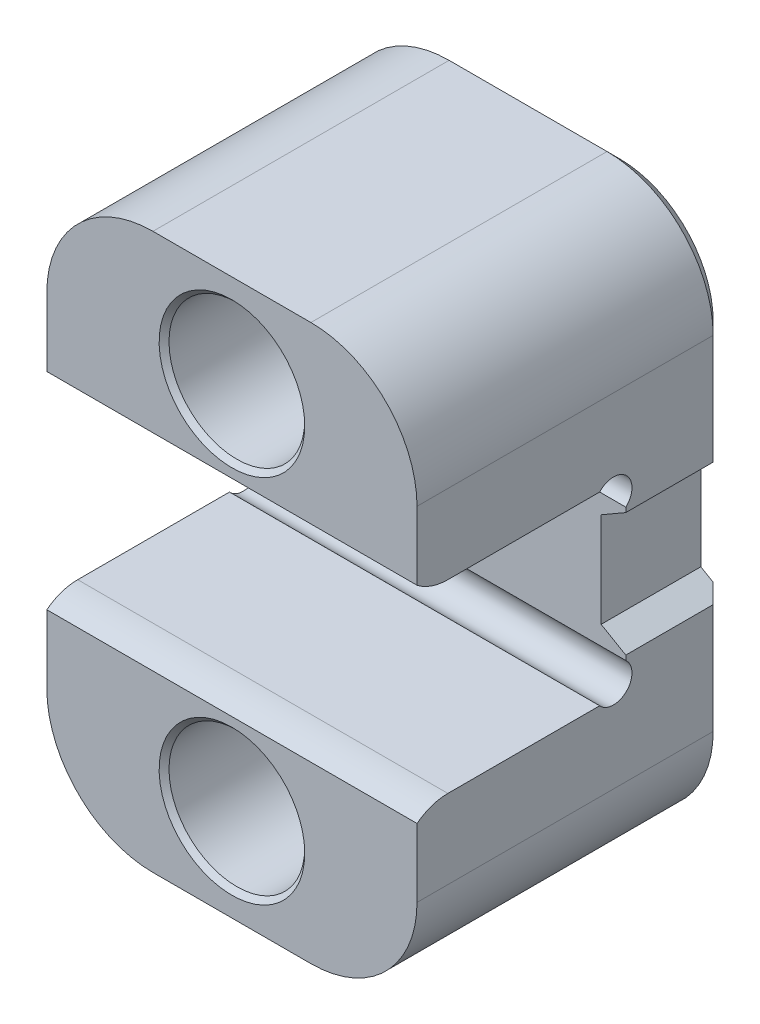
ISO-10303-21;
HEADER;
FILE_DESCRIPTION(('STEP AP214'),'2;1');
FILE_NAME('part.step','',(''),(''),'','','');
FILE_SCHEMA(('AUTOMOTIVE_DESIGN { 1 0 10303 214 1 1 1 1 }'));
ENDSEC;
DATA;
#1=APPLICATION_CONTEXT('core data for automotive mechanical design processes');
#2=APPLICATION_PROTOCOL_DEFINITION('international standard','automotive_design',2000,#1);
#3=PRODUCT_CONTEXT('',#1,'mechanical');
#4=PRODUCT('Part','Part','',(#3));
#5=PRODUCT_RELATED_PRODUCT_CATEGORY('part','',(#4));
#6=PRODUCT_DEFINITION_FORMATION('','',#4);
#7=PRODUCT_DEFINITION_CONTEXT('part definition',#1,'design');
#8=PRODUCT_DEFINITION('design','',#6,#7);
#9=PRODUCT_DEFINITION_SHAPE('','',#8);
#10=(LENGTH_UNIT() NAMED_UNIT(*) SI_UNIT(.MILLI.,.METRE.));
#11=(NAMED_UNIT(*) PLANE_ANGLE_UNIT() SI_UNIT($,.RADIAN.));
#12=(NAMED_UNIT(*) SI_UNIT($,.STERADIAN.) SOLID_ANGLE_UNIT());
#13=UNCERTAINTY_MEASURE_WITH_UNIT(LENGTH_MEASURE(1.E-05),#10,'distance_accuracy_value','');
#14=(GEOMETRIC_REPRESENTATION_CONTEXT(3) GLOBAL_UNCERTAINTY_ASSIGNED_CONTEXT((#13)) GLOBAL_UNIT_ASSIGNED_CONTEXT((#10,
#11,#12)) REPRESENTATION_CONTEXT('',''));
#15=CARTESIAN_POINT('',(0.,0.,0.));
#16=DIRECTION('',(0.,0.,1.));
#17=DIRECTION('',(1.,0.,0.));
#18=AXIS2_PLACEMENT_3D('',#15,#16,#17);
#19=CARTESIAN_POINT('',(15.,-7.5,0.));
#20=DIRECTION('',(-1.,0.,0.));
#21=DIRECTION('',(0.,0.,1.));
#22=AXIS2_PLACEMENT_3D('',#19,#20,#21);
#23=PLANE('',#22);
#24=DIRECTION('',(0.,0.,1.));
#25=VECTOR('',#24,1.);
#26=CARTESIAN_POINT('',(15.,5.,-25.));
#27=LINE('',#26,#25);
#28=CARTESIAN_POINT('',(15.,5.,-24.));
#29=VERTEX_POINT('',#28);
#30=CARTESIAN_POINT('',(15.,5.,-16.92));
#31=VERTEX_POINT('',#30);
#32=EDGE_CURVE('E419',#29,#31,#27,.T.);
#33=ORIENTED_EDGE('',*,*,#32,.F.);
#34=DIRECTION('',(0.,1.,0.));
#35=VECTOR('',#34,1.);
#36=CARTESIAN_POINT('',(15.,-7.5,-24.));
#37=LINE('',#36,#35);
#38=CARTESIAN_POINT('',(15.,13.9,-24.));
#39=VERTEX_POINT('',#38);
#40=EDGE_CURVE('E295',#29,#39,#37,.T.);
#41=ORIENTED_EDGE('',*,*,#40,.T.);
#42=DIRECTION('',(0.,0.,1.));
#43=VECTOR('',#42,1.);
#44=CARTESIAN_POINT('',(15.,13.9,0.));
#45=LINE('',#44,#43);
#46=CARTESIAN_POINT('',(15.,13.9,0.));
#47=VERTEX_POINT('',#46);
#48=EDGE_CURVE('E243',#39,#47,#45,.T.);
#49=ORIENTED_EDGE('',*,*,#48,.T.);
#50=DIRECTION('',(0.,-1.,0.));
#51=VECTOR('',#50,1.);
#52=CARTESIAN_POINT('',(15.,22.5,0.));
#53=LINE('',#52,#51);
#54=CARTESIAN_POINT('',(15.,8.35903533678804,0.));
#55=VERTEX_POINT('',#54);
#56=EDGE_CURVE('E230',#47,#55,#53,.T.);
#57=ORIENTED_EDGE('',*,*,#56,.T.);
#58=CARTESIAN_POINT('',(15.,11.5673187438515,-2.49999986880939));
#59=DIRECTION('',(-1.,0.,0.));
#60=DIRECTION('',(0.,0.,-1.));
#61=AXIS2_PLACEMENT_3D('',#58,#59,#60);
#62=CIRCLE('',#61,4.06731874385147);
#63=CARTESIAN_POINT('',(15.,7.5,-2.49999999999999));
#64=VERTEX_POINT('',#63);
#65=EDGE_CURVE('E466',#64,#55,#62,.T.);
#66=ORIENTED_EDGE('',*,*,#65,.F.);
#67=DIRECTION('',(0.,0.,-1.));
#68=VECTOR('',#67,1.);
#69=CARTESIAN_POINT('',(15.,7.5,0.));
#70=LINE('',#69,#68);
#71=CARTESIAN_POINT('',(15.,7.5,-14.8019660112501));
#72=VERTEX_POINT('',#71);
#73=EDGE_CURVE('E434',#64,#72,#70,.T.);
#74=ORIENTED_EDGE('',*,*,#73,.T.);
#75=CARTESIAN_POINT('',(15.,6.5,-15.92));
#76=DIRECTION('',(1.,0.,0.));
#77=DIRECTION('',(0.,0.,-1.));
#78=AXIS2_PLACEMENT_3D('',#75,#76,#77);
#79=CIRCLE('',#78,1.5);
#80=CARTESIAN_POINT('',(15.,5.38196601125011,-16.92));
#81=VERTEX_POINT('',#80);
#82=EDGE_CURVE('E464',#81,#72,#79,.T.);
#83=ORIENTED_EDGE('',*,*,#82,.F.);
#84=DIRECTION('',(0.,-1.,0.));
#85=VECTOR('',#84,1.);
#86=CARTESIAN_POINT('',(15.,7.5,-16.92));
#87=LINE('',#86,#85);
#88=EDGE_CURVE('E438',#81,#31,#87,.T.);
#89=ORIENTED_EDGE('',*,*,#88,.T.);
#90=EDGE_LOOP('',(#33,#41,#49,#57,#66,#74,#83,#89));
#91=FACE_BOUND('',#90,.T.);
#92=ADVANCED_FACE('F33',(#91),#23,.F.);
#93=CARTESIAN_POINT('',(15.,22.5,0.));
#94=DIRECTION('',(0.,0.,-1.));
#95=DIRECTION('',(0.,1.,0.));
#96=AXIS2_PLACEMENT_3D('',#93,#94,#95);
#97=PLANE('',#96);
#98=CARTESIAN_POINT('',(0.,15.,0.));
#99=DIRECTION('',(0.,0.,-1.));
#100=DIRECTION('',(0.,1.,0.));
#101=AXIS2_PLACEMENT_3D('',#98,#99,#100);
#102=CIRCLE('',#101,5.9);
#103=CARTESIAN_POINT('',(0.,20.9,0.));
#104=VERTEX_POINT('',#103);
#105=EDGE_CURVE('E11',#104,#104,#102,.T.);
#106=ORIENTED_EDGE('',*,*,#105,.T.);
#107=EDGE_LOOP('',(#106));
#108=FACE_BOUND('',#107,.T.);
#109=DIRECTION('',(0.,-1.,0.));
#110=VECTOR('',#109,1.);
#111=CARTESIAN_POINT('',(-15.,22.5,0.));
#112=LINE('',#111,#110);
#113=CARTESIAN_POINT('',(-15.,13.9,0.));
#114=VERTEX_POINT('',#113);
#115=CARTESIAN_POINT('',(-15.,8.35903533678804,0.));
#116=VERTEX_POINT('',#115);
#117=EDGE_CURVE('E431',#114,#116,#112,.T.);
#118=ORIENTED_EDGE('',*,*,#117,.T.);
#119=DIRECTION('',(1.,0.,0.));
#120=VECTOR('',#119,1.);
#121=CARTESIAN_POINT('',(-15.,8.35903533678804,0.));
#122=LINE('',#121,#120);
#123=EDGE_CURVE('E472',#116,#55,#122,.T.);
#124=ORIENTED_EDGE('',*,*,#123,.T.);
#125=ORIENTED_EDGE('',*,*,#56,.F.);
#126=CARTESIAN_POINT('',(6.4,13.9,0.));
#127=DIRECTION('',(0.,0.,-1.));
#128=DIRECTION('',(0.,1.,0.));
#129=AXIS2_PLACEMENT_3D('',#126,#127,#128);
#130=CIRCLE('',#129,8.6);
#131=CARTESIAN_POINT('',(6.4,22.5,0.));
#132=VERTEX_POINT('',#131);
#133=EDGE_CURVE('E260',#47,#132,#130,.F.);
#134=ORIENTED_EDGE('',*,*,#133,.T.);
#135=DIRECTION('',(-1.,0.,0.));
#136=VECTOR('',#135,1.);
#137=CARTESIAN_POINT('',(15.,22.5,0.));
#138=LINE('',#137,#136);
#139=CARTESIAN_POINT('',(-6.4,22.5,0.));
#140=VERTEX_POINT('',#139);
#141=EDGE_CURVE('E236',#132,#140,#138,.T.);
#142=ORIENTED_EDGE('',*,*,#141,.T.);
#143=CARTESIAN_POINT('',(-6.4,13.9,0.));
#144=DIRECTION('',(0.,0.,-1.));
#145=DIRECTION('',(0.,1.,0.));
#146=AXIS2_PLACEMENT_3D('',#143,#144,#145);
#147=CIRCLE('',#146,8.6);
#148=EDGE_CURVE('E258',#140,#114,#147,.F.);
#149=ORIENTED_EDGE('',*,*,#148,.T.);
#150=EDGE_LOOP('',(#118,#124,#125,#134,#142,#149));
#151=FACE_BOUND('',#150,.T.);
#152=ADVANCED_FACE('F357',(#108,#151),#97,.F.);
#153=CARTESIAN_POINT('',(15.,7.5,0.));
#154=DIRECTION('',(0.,1.,0.));
#155=DIRECTION('',(0.,0.,1.));
#156=AXIS2_PLACEMENT_3D('',#153,#154,#155);
#157=PLANE('',#156);
#158=DIRECTION('',(0.,0.,-1.));
#159=VECTOR('',#158,1.);
#160=CARTESIAN_POINT('',(-15.,7.5,0.));
#161=LINE('',#160,#159);
#162=CARTESIAN_POINT('',(-15.,7.5,-2.49999999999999));
#163=VERTEX_POINT('',#162);
#164=CARTESIAN_POINT('',(-15.,7.5,-14.8019660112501));
#165=VERTEX_POINT('',#164);
#166=EDGE_CURVE('E232',#163,#165,#161,.T.);
#167=ORIENTED_EDGE('',*,*,#166,.T.);
#168=DIRECTION('',(1.,0.,0.));
#169=VECTOR('',#168,1.);
#170=CARTESIAN_POINT('',(-15.,7.5,-14.8019660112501));
#171=LINE('',#170,#169);
#172=EDGE_CURVE('E450',#165,#72,#171,.T.);
#173=ORIENTED_EDGE('',*,*,#172,.T.);
#174=ORIENTED_EDGE('',*,*,#73,.F.);
#175=DIRECTION('',(1.,0.,0.));
#176=VECTOR('',#175,1.);
#177=CARTESIAN_POINT('',(-15.,7.5,-2.49999999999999));
#178=LINE('',#177,#176);
#179=EDGE_CURVE('E451',#163,#64,#178,.T.);
#180=ORIENTED_EDGE('',*,*,#179,.F.);
#181=EDGE_LOOP('',(#167,#173,#174,#180));
#182=FACE_BOUND('',#181,.T.);
#183=ADVANCED_FACE('F364',(#182),#157,.F.);
#184=CARTESIAN_POINT('',(15.,7.5,-16.92));
#185=DIRECTION('',(0.,0.,-1.));
#186=DIRECTION('',(-1.,0.,0.));
#187=AXIS2_PLACEMENT_3D('',#184,#185,#186);
#188=PLANE('',#187);
#189=DIRECTION('',(0.,-1.,0.));
#190=VECTOR('',#189,1.);
#191=CARTESIAN_POINT('',(-15.,7.5,-16.92));
#192=LINE('',#191,#190);
#193=CARTESIAN_POINT('',(-15.,5.38196601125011,-16.92));
#194=VERTEX_POINT('',#193);
#195=CARTESIAN_POINT('',(-15.,-5.38196601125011,-16.92));
#196=VERTEX_POINT('',#195);
#197=EDGE_CURVE('E227',#194,#196,#192,.T.);
#198=ORIENTED_EDGE('',*,*,#197,.T.);
#199=DIRECTION('',(1.,0.,0.));
#200=VECTOR('',#199,1.);
#201=CARTESIAN_POINT('',(-15.,-5.38196601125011,-16.92));
#202=LINE('',#201,#200);
#203=CARTESIAN_POINT('',(15.,-5.38196601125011,-16.92));
#204=VERTEX_POINT('',#203);
#205=EDGE_CURVE('E207',#196,#204,#202,.T.);
#206=ORIENTED_EDGE('',*,*,#205,.T.);
#207=CARTESIAN_POINT('',(15.,-5.,-16.92));
#208=VERTEX_POINT('',#207);
#209=EDGE_CURVE('E437',#208,#204,#87,.T.);
#210=ORIENTED_EDGE('',*,*,#209,.F.);
#211=DIRECTION('',(-0.866025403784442,0.499999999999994,0.));
#212=VECTOR('',#211,1.);
#213=CARTESIAN_POINT('',(9.5873412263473,-1.87500000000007,-16.92));
#214=LINE('',#213,#212);
#215=CARTESIAN_POINT('',(13.,-3.84529946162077,-16.92));
#216=VERTEX_POINT('',#215);
#217=EDGE_CURVE('E418',#208,#216,#214,.T.);
#218=ORIENTED_EDGE('',*,*,#217,.T.);
#219=DIRECTION('',(0.,1.,0.));
#220=VECTOR('',#219,1.);
#221=CARTESIAN_POINT('',(13.,7.5,-16.92));
#222=LINE('',#221,#220);
#223=CARTESIAN_POINT('',(13.,3.84529946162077,-16.92));
#224=VERTEX_POINT('',#223);
#225=EDGE_CURVE('E428',#216,#224,#222,.T.);
#226=ORIENTED_EDGE('',*,*,#225,.T.);
#227=DIRECTION('',(0.866025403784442,0.499999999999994,0.));
#228=VECTOR('',#227,1.);
#229=CARTESIAN_POINT('',(16.0825317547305,5.62499999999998,-16.92));
#230=LINE('',#229,#228);
#231=EDGE_CURVE('E425',#224,#31,#230,.T.);
#232=ORIENTED_EDGE('',*,*,#231,.T.);
#233=ORIENTED_EDGE('',*,*,#88,.F.);
#234=DIRECTION('',(1.,0.,0.));
#235=VECTOR('',#234,1.);
#236=CARTESIAN_POINT('',(-15.,5.38196601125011,-16.92));
#237=LINE('',#236,#235);
#238=EDGE_CURVE('E459',#81,#194,#237,.F.);
#239=ORIENTED_EDGE('',*,*,#238,.T.);
#240=EDGE_LOOP('',(#198,#206,#210,#218,#226,#232,#233,#239));
#241=FACE_BOUND('',#240,.T.);
#242=ADVANCED_FACE('F463',(#241),#188,.F.);
#243=CARTESIAN_POINT('',(15.,-7.5,-16.92));
#244=DIRECTION('',(0.,-1.,0.));
#245=DIRECTION('',(0.,0.,-1.));
#246=AXIS2_PLACEMENT_3D('',#243,#244,#245);
#247=PLANE('',#246);
#248=DIRECTION('',(0.,0.,1.));
#249=VECTOR('',#248,1.);
#250=CARTESIAN_POINT('',(15.,-7.5,-16.92));
#251=LINE('',#250,#249);
#252=CARTESIAN_POINT('',(15.,-7.5,-14.8019660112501));
#253=VERTEX_POINT('',#252);
#254=CARTESIAN_POINT('',(15.,-7.5,-2.49999999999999));
#255=VERTEX_POINT('',#254);
#256=EDGE_CURVE('E220',#253,#255,#251,.T.);
#257=ORIENTED_EDGE('',*,*,#256,.F.);
#258=DIRECTION('',(1.,0.,0.));
#259=VECTOR('',#258,1.);
#260=CARTESIAN_POINT('',(-15.,-7.5,-14.8019660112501));
#261=LINE('',#260,#259);
#262=CARTESIAN_POINT('',(-15.,-7.5,-14.8019660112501));
#263=VERTEX_POINT('',#262);
#264=EDGE_CURVE('E204',#253,#263,#261,.F.);
#265=ORIENTED_EDGE('',*,*,#264,.T.);
#266=DIRECTION('',(0.,0.,1.));
#267=VECTOR('',#266,1.);
#268=CARTESIAN_POINT('',(-15.,-7.5,-16.92));
#269=LINE('',#268,#267);
#270=CARTESIAN_POINT('',(-15.,-7.5,-2.49999999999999));
#271=VERTEX_POINT('',#270);
#272=EDGE_CURVE('E218',#263,#271,#269,.T.);
#273=ORIENTED_EDGE('',*,*,#272,.T.);
#274=DIRECTION('',(1.,0.,0.));
#275=VECTOR('',#274,1.);
#276=CARTESIAN_POINT('',(-15.,-7.5,-2.49999999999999));
#277=LINE('',#276,#275);
#278=EDGE_CURVE('E479',#271,#255,#277,.T.);
#279=ORIENTED_EDGE('',*,*,#278,.T.);
#280=EDGE_LOOP('',(#257,#265,#273,#279));
#281=FACE_BOUND('',#280,.T.);
#282=ADVANCED_FACE('F216',(#281),#247,.F.);
#283=CARTESIAN_POINT('',(15.,-7.5,0.));
#284=DIRECTION('',(0.,0.,-1.));
#285=DIRECTION('',(0.,1.,0.));
#286=AXIS2_PLACEMENT_3D('',#283,#284,#285);
#287=PLANE('',#286);
#288=CARTESIAN_POINT('',(0.,-15.,0.));
#289=DIRECTION('',(0.,0.,-1.));
#290=DIRECTION('',(0.,1.,0.));
#291=AXIS2_PLACEMENT_3D('',#288,#289,#290);
#292=CIRCLE('',#291,5.90000000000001);
#293=CARTESIAN_POINT('',(0.,-9.09999999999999,0.));
#294=VERTEX_POINT('',#293);
#295=EDGE_CURVE('E339',#294,#294,#292,.T.);
#296=ORIENTED_EDGE('',*,*,#295,.T.);
#297=EDGE_LOOP('',(#296));
#298=FACE_BOUND('',#297,.T.);
#299=DIRECTION('',(0.,-1.,0.));
#300=VECTOR('',#299,1.);
#301=CARTESIAN_POINT('',(15.,-7.5,0.));
#302=LINE('',#301,#300);
#303=CARTESIAN_POINT('',(15.,-8.35903533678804,0.));
#304=VERTEX_POINT('',#303);
#305=CARTESIAN_POINT('',(15.,-13.9,0.));
#306=VERTEX_POINT('',#305);
#307=EDGE_CURVE('E240',#304,#306,#302,.T.);
#308=ORIENTED_EDGE('',*,*,#307,.F.);
#309=DIRECTION('',(1.,0.,0.));
#310=VECTOR('',#309,1.);
#311=CARTESIAN_POINT('',(-15.,-8.35903533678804,0.));
#312=LINE('',#311,#310);
#313=CARTESIAN_POINT('',(-15.,-8.35903533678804,0.));
#314=VERTEX_POINT('',#313);
#315=EDGE_CURVE('E411',#314,#304,#312,.T.);
#316=ORIENTED_EDGE('',*,*,#315,.F.);
#317=DIRECTION('',(0.,-1.,0.));
#318=VECTOR('',#317,1.);
#319=CARTESIAN_POINT('',(-15.,-7.5,0.));
#320=LINE('',#319,#318);
#321=CARTESIAN_POINT('',(-15.,-13.9,0.));
#322=VERTEX_POINT('',#321);
#323=EDGE_CURVE('E226',#314,#322,#320,.T.);
#324=ORIENTED_EDGE('',*,*,#323,.T.);
#325=CARTESIAN_POINT('',(-6.4,-13.9,0.));
#326=DIRECTION('',(0.,0.,-1.));
#327=DIRECTION('',(0.,1.,0.));
#328=AXIS2_PLACEMENT_3D('',#325,#326,#327);
#329=CIRCLE('',#328,8.6);
#330=CARTESIAN_POINT('',(-6.4,-22.5,0.));
#331=VERTEX_POINT('',#330);
#332=EDGE_CURVE('E253',#322,#331,#329,.F.);
#333=ORIENTED_EDGE('',*,*,#332,.T.);
#334=DIRECTION('',(-1.,0.,0.));
#335=VECTOR('',#334,1.);
#336=CARTESIAN_POINT('',(15.,-22.5,0.));
#337=LINE('',#336,#335);
#338=CARTESIAN_POINT('',(6.4,-22.5,0.));
#339=VERTEX_POINT('',#338);
#340=EDGE_CURVE('E239',#339,#331,#337,.T.);
#341=ORIENTED_EDGE('',*,*,#340,.F.);
#342=CARTESIAN_POINT('',(6.4,-13.9,0.));
#343=DIRECTION('',(0.,0.,-1.));
#344=DIRECTION('',(0.,1.,0.));
#345=AXIS2_PLACEMENT_3D('',#342,#343,#344);
#346=CIRCLE('',#345,8.6);
#347=EDGE_CURVE('E255',#339,#306,#346,.F.);
#348=ORIENTED_EDGE('',*,*,#347,.T.);
#349=EDGE_LOOP('',(#308,#316,#324,#333,#341,#348));
#350=FACE_BOUND('',#349,.T.);
#351=ADVANCED_FACE('F486',(#298,#350),#287,.F.);
#352=CARTESIAN_POINT('',(15.,-22.5,0.));
#353=DIRECTION('',(0.,1.,0.));
#354=DIRECTION('',(0.,0.,1.));
#355=AXIS2_PLACEMENT_3D('',#352,#353,#354);
#356=PLANE('',#355);
#357=DIRECTION('',(0.,0.,-1.));
#358=VECTOR('',#357,1.);
#359=CARTESIAN_POINT('',(-6.4,-22.5,-25.));
#360=LINE('',#359,#358);
#361=CARTESIAN_POINT('',(-6.4,-22.5,-24.));
#362=VERTEX_POINT('',#361);
#363=EDGE_CURVE('E248',#331,#362,#360,.T.);
#364=ORIENTED_EDGE('',*,*,#363,.T.);
#365=DIRECTION('',(1.,0.,0.));
#366=VECTOR('',#365,1.);
#367=CARTESIAN_POINT('',(15.,-22.5,-24.));
#368=LINE('',#367,#366);
#369=CARTESIAN_POINT('',(6.4,-22.5,-24.));
#370=VERTEX_POINT('',#369);
#371=EDGE_CURVE('E303',#362,#370,#368,.T.);
#372=ORIENTED_EDGE('',*,*,#371,.T.);
#373=DIRECTION('',(0.,0.,-1.));
#374=VECTOR('',#373,1.);
#375=CARTESIAN_POINT('',(6.4,-22.5,0.));
#376=LINE('',#375,#374);
#377=EDGE_CURVE('E251',#370,#339,#376,.F.);
#378=ORIENTED_EDGE('',*,*,#377,.T.);
#379=ORIENTED_EDGE('',*,*,#340,.T.);
#380=EDGE_LOOP('',(#364,#372,#378,#379));
#381=FACE_BOUND('',#380,.T.);
#382=ADVANCED_FACE('F685',(#381),#356,.F.);
#383=CARTESIAN_POINT('',(15.,22.5,-25.));
#384=DIRECTION('',(0.,0.,1.));
#385=DIRECTION('',(1.,0.,0.));
#386=AXIS2_PLACEMENT_3D('',#383,#384,#385);
#387=PLANE('',#386);
#388=DIRECTION('',(0.866025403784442,-0.499999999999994,0.));
#389=VECTOR('',#388,1.);
#390=CARTESIAN_POINT('',(13.,-3.84529946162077,-25.));
#391=LINE('',#390,#389);
#392=CARTESIAN_POINT('',(13.,-3.84529946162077,-25.));
#393=VERTEX_POINT('',#392);
#394=CARTESIAN_POINT('',(14.,-4.42264973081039,-25.));
#395=VERTEX_POINT('',#394);
#396=EDGE_CURVE('E399',#393,#395,#391,.T.);
#397=ORIENTED_EDGE('',*,*,#396,.T.);
#398=DIRECTION('',(0.,-1.,0.));
#399=VECTOR('',#398,1.);
#400=CARTESIAN_POINT('',(14.,22.5,-25.));
#401=LINE('',#400,#399);
#402=CARTESIAN_POINT('',(14.,-13.9,-25.));
#403=VERTEX_POINT('',#402);
#404=EDGE_CURVE('E293',#395,#403,#401,.T.);
#405=ORIENTED_EDGE('',*,*,#404,.T.);
#406=CARTESIAN_POINT('',(6.4,-13.9,-25.));
#407=DIRECTION('',(0.,0.,1.));
#408=DIRECTION('',(1.,0.,0.));
#409=AXIS2_PLACEMENT_3D('',#406,#407,#408);
#410=CIRCLE('',#409,7.60000000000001);
#411=CARTESIAN_POINT('',(6.4,-21.5,-25.));
#412=VERTEX_POINT('',#411);
#413=EDGE_CURVE('E289',#403,#412,#410,.F.);
#414=ORIENTED_EDGE('',*,*,#413,.T.);
#415=DIRECTION('',(-1.,0.,0.));
#416=VECTOR('',#415,1.);
#417=CARTESIAN_POINT('',(15.,-21.5,-25.));
#418=LINE('',#417,#416);
#419=CARTESIAN_POINT('',(-6.4,-21.5,-25.));
#420=VERTEX_POINT('',#419);
#421=EDGE_CURVE('E285',#412,#420,#418,.T.);
#422=ORIENTED_EDGE('',*,*,#421,.T.);
#423=CARTESIAN_POINT('',(-6.4,-13.9,-25.));
#424=DIRECTION('',(0.,0.,1.));
#425=DIRECTION('',(1.,0.,0.));
#426=AXIS2_PLACEMENT_3D('',#423,#424,#425);
#427=CIRCLE('',#426,7.6);
#428=CARTESIAN_POINT('',(-14.,-13.9,-25.));
#429=VERTEX_POINT('',#428);
#430=EDGE_CURVE('E283',#420,#429,#427,.F.);
#431=ORIENTED_EDGE('',*,*,#430,.T.);
#432=DIRECTION('',(0.,1.,0.));
#433=VECTOR('',#432,1.);
#434=CARTESIAN_POINT('',(-14.,13.9,-25.));
#435=LINE('',#434,#433);
#436=CARTESIAN_POINT('',(-14.,13.9,-25.));
#437=VERTEX_POINT('',#436);
#438=EDGE_CURVE('E279',#429,#437,#435,.T.);
#439=ORIENTED_EDGE('',*,*,#438,.T.);
#440=CARTESIAN_POINT('',(-6.4,13.9,-25.));
#441=DIRECTION('',(0.,0.,1.));
#442=DIRECTION('',(1.,0.,0.));
#443=AXIS2_PLACEMENT_3D('',#440,#441,#442);
#444=CIRCLE('',#443,7.60000000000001);
#445=CARTESIAN_POINT('',(-6.4,21.5,-25.));
#446=VERTEX_POINT('',#445);
#447=EDGE_CURVE('E277',#437,#446,#444,.F.);
#448=ORIENTED_EDGE('',*,*,#447,.T.);
#449=DIRECTION('',(1.,0.,0.));
#450=VECTOR('',#449,1.);
#451=CARTESIAN_POINT('',(15.,21.5,-25.));
#452=LINE('',#451,#450);
#453=CARTESIAN_POINT('',(6.4,21.5,-25.));
#454=VERTEX_POINT('',#453);
#455=EDGE_CURVE('E281',#446,#454,#452,.T.);
#456=ORIENTED_EDGE('',*,*,#455,.T.);
#457=CARTESIAN_POINT('',(6.4,13.9,-25.));
#458=DIRECTION('',(0.,0.,1.));
#459=DIRECTION('',(1.,0.,0.));
#460=AXIS2_PLACEMENT_3D('',#457,#458,#459);
#461=CIRCLE('',#460,7.6);
#462=CARTESIAN_POINT('',(14.,13.9,-25.));
#463=VERTEX_POINT('',#462);
#464=EDGE_CURVE('E287',#454,#463,#461,.F.);
#465=ORIENTED_EDGE('',*,*,#464,.T.);
#466=DIRECTION('',(0.,-1.,0.));
#467=VECTOR('',#466,1.);
#468=CARTESIAN_POINT('',(14.,22.5,-25.));
#469=LINE('',#468,#467);
#470=CARTESIAN_POINT('',(14.,4.42264973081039,-25.));
#471=VERTEX_POINT('',#470);
#472=EDGE_CURVE('E291',#463,#471,#469,.T.);
#473=ORIENTED_EDGE('',*,*,#472,.T.);
#474=DIRECTION('',(-0.866025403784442,-0.499999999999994,0.));
#475=VECTOR('',#474,1.);
#476=CARTESIAN_POINT('',(13.,3.84529946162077,-25.));
#477=LINE('',#476,#475);
#478=CARTESIAN_POINT('',(13.,3.84529946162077,-25.));
#479=VERTEX_POINT('',#478);
#480=EDGE_CURVE('E407',#471,#479,#477,.T.);
#481=ORIENTED_EDGE('',*,*,#480,.T.);
#482=DIRECTION('',(0.,-1.,0.));
#483=VECTOR('',#482,1.);
#484=CARTESIAN_POINT('',(13.,-3.84529946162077,-25.));
#485=LINE('',#484,#483);
#486=EDGE_CURVE('E406',#479,#393,#485,.T.);
#487=ORIENTED_EDGE('',*,*,#486,.T.);
#488=EDGE_LOOP('',(#397,#405,#414,#422,#431,#439,#448,#456,#465,#473,#481,#487));
#489=FACE_BOUND('',#488,.T.);
#490=CARTESIAN_POINT('',(0.,15.,-25.));
#491=DIRECTION('',(0.,0.,1.));
#492=DIRECTION('',(1.,0.,0.));
#493=AXIS2_PLACEMENT_3D('',#490,#491,#492);
#494=CIRCLE('',#493,3.49999999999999);
#495=CARTESIAN_POINT('',(3.49999999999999,15.,-25.));
#496=VERTEX_POINT('',#495);
#497=EDGE_CURVE('E543',#496,#496,#494,.T.);
#498=ORIENTED_EDGE('',*,*,#497,.T.);
#499=EDGE_LOOP('',(#498));
#500=FACE_BOUND('',#499,.T.);
#501=CARTESIAN_POINT('',(0.,-15.,-25.));
#502=DIRECTION('',(0.,0.,1.));
#503=DIRECTION('',(1.,0.,0.));
#504=AXIS2_PLACEMENT_3D('',#501,#502,#503);
#505=CIRCLE('',#504,3.49999999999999);
#506=CARTESIAN_POINT('',(3.49999999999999,-15.,-25.));
#507=VERTEX_POINT('',#506);
#508=EDGE_CURVE('E532',#507,#507,#505,.T.);
#509=ORIENTED_EDGE('',*,*,#508,.T.);
#510=EDGE_LOOP('',(#509));
#511=FACE_BOUND('',#510,.T.);
#512=ADVANCED_FACE('F378',(#489,#500,#511),#387,.F.);
#513=CARTESIAN_POINT('',(15.,22.5,0.));
#514=DIRECTION('',(0.,-1.,0.));
#515=DIRECTION('',(0.,0.,-1.));
#516=AXIS2_PLACEMENT_3D('',#513,#514,#515);
#517=PLANE('',#516);
#518=DIRECTION('',(0.,0.,1.));
#519=VECTOR('',#518,1.);
#520=CARTESIAN_POINT('',(6.4,22.5,0.));
#521=LINE('',#520,#519);
#522=CARTESIAN_POINT('',(6.4,22.5,-24.));
#523=VERTEX_POINT('',#522);
#524=EDGE_CURVE('E264',#132,#523,#521,.F.);
#525=ORIENTED_EDGE('',*,*,#524,.T.);
#526=DIRECTION('',(-1.,0.,0.));
#527=VECTOR('',#526,1.);
#528=CARTESIAN_POINT('',(15.,22.5,-24.));
#529=LINE('',#528,#527);
#530=CARTESIAN_POINT('',(-6.4,22.5,-24.));
#531=VERTEX_POINT('',#530);
#532=EDGE_CURVE('E56',#523,#531,#529,.T.);
#533=ORIENTED_EDGE('',*,*,#532,.T.);
#534=DIRECTION('',(0.,0.,1.));
#535=VECTOR('',#534,1.);
#536=CARTESIAN_POINT('',(-6.4,22.5,0.));
#537=LINE('',#536,#535);
#538=EDGE_CURVE('E262',#531,#140,#537,.T.);
#539=ORIENTED_EDGE('',*,*,#538,.T.);
#540=ORIENTED_EDGE('',*,*,#141,.F.);
#541=EDGE_LOOP('',(#525,#533,#539,#540));
#542=FACE_BOUND('',#541,.T.);
#543=ADVANCED_FACE('F371',(#542),#517,.F.);
#544=DIRECTION('',(0.,0.,-1.));
#545=VECTOR('',#544,1.);
#546=CARTESIAN_POINT('',(15.,-13.9,0.));
#547=LINE('',#546,#545);
#548=CARTESIAN_POINT('',(15.,-13.9,-24.));
#549=VERTEX_POINT('',#548);
#550=EDGE_CURVE('E245',#306,#549,#547,.T.);
#551=ORIENTED_EDGE('',*,*,#550,.T.);
#552=DIRECTION('',(0.,1.,0.));
#553=VECTOR('',#552,1.);
#554=CARTESIAN_POINT('',(15.,-7.5,-24.));
#555=LINE('',#554,#553);
#556=CARTESIAN_POINT('',(15.,-5.,-24.));
#557=VERTEX_POINT('',#556);
#558=EDGE_CURVE('E272',#549,#557,#555,.T.);
#559=ORIENTED_EDGE('',*,*,#558,.T.);
#560=DIRECTION('',(0.,0.,1.));
#561=VECTOR('',#560,1.);
#562=CARTESIAN_POINT('',(15.,-5.,-25.));
#563=LINE('',#562,#561);
#564=EDGE_CURVE('E402',#557,#208,#563,.T.);
#565=ORIENTED_EDGE('',*,*,#564,.T.);
#566=ORIENTED_EDGE('',*,*,#209,.T.);
#567=CARTESIAN_POINT('',(15.,-6.5,-15.92));
#568=DIRECTION('',(1.,0.,0.));
#569=DIRECTION('',(0.,0.,1.));
#570=AXIS2_PLACEMENT_3D('',#567,#568,#569);
#571=CIRCLE('',#570,1.5);
#572=EDGE_CURVE('E212',#253,#204,#571,.T.);
#573=ORIENTED_EDGE('',*,*,#572,.F.);
#574=ORIENTED_EDGE('',*,*,#256,.T.);
#575=CARTESIAN_POINT('',(15.,-11.5673187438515,-2.49999986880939));
#576=DIRECTION('',(-1.,0.,0.));
#577=DIRECTION('',(0.,0.,1.));
#578=AXIS2_PLACEMENT_3D('',#575,#576,#577);
#579=CIRCLE('',#578,4.06731874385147);
#580=EDGE_CURVE('E475',#304,#255,#579,.T.);
#581=ORIENTED_EDGE('',*,*,#580,.F.);
#582=ORIENTED_EDGE('',*,*,#307,.T.);
#583=EDGE_LOOP('',(#551,#559,#565,#566,#573,#574,#581,#582));
#584=FACE_BOUND('',#583,.T.);
#585=ADVANCED_FACE('F360',(#584),#23,.F.);
#586=CARTESIAN_POINT('',(-15.,-7.5,0.));
#587=DIRECTION('',(-1.,0.,0.));
#588=DIRECTION('',(0.,0.,1.));
#589=AXIS2_PLACEMENT_3D('',#586,#587,#588);
#590=PLANE('',#589);
#591=DIRECTION('',(0.,0.,1.));
#592=VECTOR('',#591,1.);
#593=CARTESIAN_POINT('',(-15.,13.9,-25.));
#594=LINE('',#593,#592);
#595=CARTESIAN_POINT('',(-15.,13.9,-24.));
#596=VERTEX_POINT('',#595);
#597=EDGE_CURVE('E266',#114,#596,#594,.F.);
#598=ORIENTED_EDGE('',*,*,#597,.T.);
#599=DIRECTION('',(0.,-1.,0.));
#600=VECTOR('',#599,1.);
#601=CARTESIAN_POINT('',(-15.,-13.9,-24.));
#602=LINE('',#601,#600);
#603=CARTESIAN_POINT('',(-15.,-13.9,-24.));
#604=VERTEX_POINT('',#603);
#605=EDGE_CURVE('E308',#596,#604,#602,.T.);
#606=ORIENTED_EDGE('',*,*,#605,.T.);
#607=DIRECTION('',(0.,0.,-1.));
#608=VECTOR('',#607,1.);
#609=CARTESIAN_POINT('',(-15.,-13.9,0.));
#610=LINE('',#609,#608);
#611=EDGE_CURVE('E268',#604,#322,#610,.F.);
#612=ORIENTED_EDGE('',*,*,#611,.T.);
#613=ORIENTED_EDGE('',*,*,#323,.F.);
#614=CARTESIAN_POINT('',(-15.,-11.5673187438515,-2.49999986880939));
#615=DIRECTION('',(-1.,0.,0.));
#616=DIRECTION('',(0.,0.,1.));
#617=AXIS2_PLACEMENT_3D('',#614,#615,#616);
#618=CIRCLE('',#617,4.06731874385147);
#619=EDGE_CURVE('E225',#314,#271,#618,.T.);
#620=ORIENTED_EDGE('',*,*,#619,.T.);
#621=ORIENTED_EDGE('',*,*,#272,.F.);
#622=CARTESIAN_POINT('',(-15.,-6.5,-15.92));
#623=DIRECTION('',(1.,0.,0.));
#624=DIRECTION('',(0.,0.,1.));
#625=AXIS2_PLACEMENT_3D('',#622,#623,#624);
#626=CIRCLE('',#625,1.5);
#627=EDGE_CURVE('E201',#263,#196,#626,.T.);
#628=ORIENTED_EDGE('',*,*,#627,.T.);
#629=ORIENTED_EDGE('',*,*,#197,.F.);
#630=CARTESIAN_POINT('',(-15.,6.5,-15.92));
#631=DIRECTION('',(-1.,0.,0.));
#632=DIRECTION('',(0.,0.,1.));
#633=AXIS2_PLACEMENT_3D('',#630,#631,#632);
#634=CIRCLE('',#633,1.5);
#635=EDGE_CURVE('E270',#165,#194,#634,.T.);
#636=ORIENTED_EDGE('',*,*,#635,.F.);
#637=ORIENTED_EDGE('',*,*,#166,.F.);
#638=CARTESIAN_POINT('',(-15.,11.5673187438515,-2.49999986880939));
#639=DIRECTION('',(-1.,0.,0.));
#640=DIRECTION('',(0.,0.,-1.));
#641=AXIS2_PLACEMENT_3D('',#638,#639,#640);
#642=CIRCLE('',#641,4.06731874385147);
#643=EDGE_CURVE('E455',#163,#116,#642,.T.);
#644=ORIENTED_EDGE('',*,*,#643,.T.);
#645=ORIENTED_EDGE('',*,*,#117,.F.);
#646=EDGE_LOOP('',(#598,#606,#612,#613,#620,#621,#628,#629,#636,#637,#644,#645));
#647=FACE_BOUND('',#646,.T.);
#648=ADVANCED_FACE('F223',(#647),#590,.T.);
#649=CARTESIAN_POINT('',(6.4,-13.9,0.));
#650=DIRECTION('',(0.,0.,-1.));
#651=DIRECTION('',(-1.,0.,0.));
#652=AXIS2_PLACEMENT_3D('',#649,#650,#651);
#653=CYLINDRICAL_SURFACE('',#652,8.6);
#654=ORIENTED_EDGE('',*,*,#377,.F.);
#655=CARTESIAN_POINT('',(6.4,-13.9,-24.));
#656=DIRECTION('',(0.,0.,1.));
#657=DIRECTION('',(1.,0.,0.));
#658=AXIS2_PLACEMENT_3D('',#655,#656,#657);
#659=CIRCLE('',#658,8.6);
#660=EDGE_CURVE('E299',#370,#549,#659,.T.);
#661=ORIENTED_EDGE('',*,*,#660,.T.);
#662=ORIENTED_EDGE('',*,*,#550,.F.);
#663=ORIENTED_EDGE('',*,*,#347,.F.);
#664=EDGE_LOOP('',(#654,#661,#662,#663));
#665=FACE_BOUND('',#664,.T.);
#666=ADVANCED_FACE('F377',(#665),#653,.T.);
#667=CARTESIAN_POINT('',(6.4,13.9,0.));
#668=DIRECTION('',(0.,0.,1.));
#669=DIRECTION('',(1.,0.,0.));
#670=AXIS2_PLACEMENT_3D('',#667,#668,#669);
#671=CYLINDRICAL_SURFACE('',#670,8.6);
#672=ORIENTED_EDGE('',*,*,#48,.F.);
#673=CARTESIAN_POINT('',(6.4,13.9,-24.));
#674=DIRECTION('',(0.,0.,1.));
#675=DIRECTION('',(1.,0.,0.));
#676=AXIS2_PLACEMENT_3D('',#673,#674,#675);
#677=CIRCLE('',#676,8.6);
#678=EDGE_CURVE('E301',#39,#523,#677,.T.);
#679=ORIENTED_EDGE('',*,*,#678,.T.);
#680=ORIENTED_EDGE('',*,*,#524,.F.);
#681=ORIENTED_EDGE('',*,*,#133,.F.);
#682=EDGE_LOOP('',(#672,#679,#680,#681));
#683=FACE_BOUND('',#682,.T.);
#684=ADVANCED_FACE('F602',(#683),#671,.T.);
#685=CARTESIAN_POINT('',(-6.4,-13.9,0.));
#686=DIRECTION('',(0.,0.,1.));
#687=DIRECTION('',(1.,0.,0.));
#688=AXIS2_PLACEMENT_3D('',#685,#686,#687);
#689=CYLINDRICAL_SURFACE('',#688,8.6);
#690=ORIENTED_EDGE('',*,*,#611,.F.);
#691=CARTESIAN_POINT('',(-6.4,-13.9,-24.));
#692=DIRECTION('',(0.,0.,1.));
#693=DIRECTION('',(1.,0.,0.));
#694=AXIS2_PLACEMENT_3D('',#691,#692,#693);
#695=CIRCLE('',#694,8.6);
#696=EDGE_CURVE('E305',#604,#362,#695,.T.);
#697=ORIENTED_EDGE('',*,*,#696,.T.);
#698=ORIENTED_EDGE('',*,*,#363,.F.);
#699=ORIENTED_EDGE('',*,*,#332,.F.);
#700=EDGE_LOOP('',(#690,#697,#698,#699));
#701=FACE_BOUND('',#700,.T.);
#702=ADVANCED_FACE('F597',(#701),#689,.T.);
#703=CARTESIAN_POINT('',(-6.4,13.9,0.));
#704=DIRECTION('',(0.,0.,-1.));
#705=DIRECTION('',(-1.,0.,0.));
#706=AXIS2_PLACEMENT_3D('',#703,#704,#705);
#707=CYLINDRICAL_SURFACE('',#706,8.6);
#708=ORIENTED_EDGE('',*,*,#538,.F.);
#709=CARTESIAN_POINT('',(-6.4,13.9,-24.));
#710=DIRECTION('',(0.,0.,1.));
#711=DIRECTION('',(1.,0.,0.));
#712=AXIS2_PLACEMENT_3D('',#709,#710,#711);
#713=CIRCLE('',#712,8.6);
#714=EDGE_CURVE('E48',#531,#596,#713,.T.);
#715=ORIENTED_EDGE('',*,*,#714,.T.);
#716=ORIENTED_EDGE('',*,*,#597,.F.);
#717=ORIENTED_EDGE('',*,*,#148,.F.);
#718=EDGE_LOOP('',(#708,#715,#716,#717));
#719=FACE_BOUND('',#718,.T.);
#720=ADVANCED_FACE('F593',(#719),#707,.T.);
#721=CARTESIAN_POINT('',(13.,-3.84529946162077,-25.));
#722=DIRECTION('',(-1.,0.,0.));
#723=DIRECTION('',(0.,0.,1.));
#724=AXIS2_PLACEMENT_3D('',#721,#722,#723);
#725=PLANE('',#724);
#726=DIRECTION('',(0.,0.,1.));
#727=VECTOR('',#726,1.);
#728=CARTESIAN_POINT('',(13.,-3.84529946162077,-25.));
#729=LINE('',#728,#727);
#730=EDGE_CURVE('E409',#393,#216,#729,.T.);
#731=ORIENTED_EDGE('',*,*,#730,.F.);
#732=ORIENTED_EDGE('',*,*,#486,.F.);
#733=DIRECTION('',(0.,0.,1.));
#734=VECTOR('',#733,1.);
#735=CARTESIAN_POINT('',(13.,3.84529946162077,-25.));
#736=LINE('',#735,#734);
#737=EDGE_CURVE('E415',#479,#224,#736,.T.);
#738=ORIENTED_EDGE('',*,*,#737,.T.);
#739=ORIENTED_EDGE('',*,*,#225,.F.);
#740=EDGE_LOOP('',(#731,#732,#738,#739));
#741=FACE_BOUND('',#740,.T.);
#742=ADVANCED_FACE('F529',(#741),#725,.F.);
#743=CARTESIAN_POINT('',(13.,3.84529946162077,-25.));
#744=DIRECTION('',(-0.499999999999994,0.866025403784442,0.));
#745=DIRECTION('',(-0.866025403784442,-0.499999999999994,0.));
#746=AXIS2_PLACEMENT_3D('',#743,#744,#745);
#747=PLANE('',#746);
#748=ORIENTED_EDGE('',*,*,#480,.F.);
#749=DIRECTION('',(-0.654653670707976,-0.377964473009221,-0.654653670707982));
#750=VECTOR('',#749,1.);
#751=CARTESIAN_POINT('',(11.9070521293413,3.21428571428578,-27.0929478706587));
#752=LINE('',#751,#750);
#753=EDGE_CURVE('E297',#471,#29,#752,.F.);
#754=ORIENTED_EDGE('',*,*,#753,.T.);
#755=ORIENTED_EDGE('',*,*,#32,.T.);
#756=ORIENTED_EDGE('',*,*,#231,.F.);
#757=ORIENTED_EDGE('',*,*,#737,.F.);
#758=EDGE_LOOP('',(#748,#754,#755,#756,#757));
#759=FACE_BOUND('',#758,.T.);
#760=ADVANCED_FACE('F527',(#759),#747,.F.);
#761=CARTESIAN_POINT('',(13.,-3.84529946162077,-25.));
#762=DIRECTION('',(-0.499999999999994,-0.866025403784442,0.));
#763=DIRECTION('',(0.866025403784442,-0.499999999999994,0.));
#764=AXIS2_PLACEMENT_3D('',#761,#762,#763);
#765=PLANE('',#764);
#766=ORIENTED_EDGE('',*,*,#564,.F.);
#767=DIRECTION('',(0.654653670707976,-0.377964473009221,0.654653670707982));
#768=VECTOR('',#767,1.);
#769=CARTESIAN_POINT('',(15.6185895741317,-5.35714285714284,-23.3814104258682));
#770=LINE('',#769,#768);
#771=EDGE_CURVE('E275',#557,#395,#770,.F.);
#772=ORIENTED_EDGE('',*,*,#771,.T.);
#773=ORIENTED_EDGE('',*,*,#396,.F.);
#774=ORIENTED_EDGE('',*,*,#730,.T.);
#775=ORIENTED_EDGE('',*,*,#217,.F.);
#776=EDGE_LOOP('',(#766,#772,#773,#774,#775));
#777=FACE_BOUND('',#776,.T.);
#778=ADVANCED_FACE('F397',(#777),#765,.F.);
#779=CARTESIAN_POINT('',(-15.,-11.5673187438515,-2.49999986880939));
#780=DIRECTION('',(1.,0.,0.));
#781=DIRECTION('',(0.,0.,-1.));
#782=AXIS2_PLACEMENT_3D('',#779,#780,#781);
#783=CYLINDRICAL_SURFACE('',#782,4.06731874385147);
#784=ORIENTED_EDGE('',*,*,#580,.T.);
#785=ORIENTED_EDGE('',*,*,#278,.F.);
#786=ORIENTED_EDGE('',*,*,#619,.F.);
#787=ORIENTED_EDGE('',*,*,#315,.T.);
#788=EDGE_LOOP('',(#784,#785,#786,#787));
#789=FACE_BOUND('',#788,.T.);
#790=ADVANCED_FACE('F483',(#789),#783,.T.);
#791=CARTESIAN_POINT('',(-15.,11.5673187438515,-2.49999986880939));
#792=DIRECTION('',(1.,0.,0.));
#793=DIRECTION('',(0.,0.,-1.));
#794=AXIS2_PLACEMENT_3D('',#791,#792,#793);
#795=CYLINDRICAL_SURFACE('',#794,4.06731874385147);
#796=ORIENTED_EDGE('',*,*,#65,.T.);
#797=ORIENTED_EDGE('',*,*,#123,.F.);
#798=ORIENTED_EDGE('',*,*,#643,.F.);
#799=ORIENTED_EDGE('',*,*,#179,.T.);
#800=EDGE_LOOP('',(#796,#797,#798,#799));
#801=FACE_BOUND('',#800,.T.);
#802=ADVANCED_FACE('F583',(#801),#795,.T.);
#803=CARTESIAN_POINT('',(-15.,6.5,-15.92));
#804=DIRECTION('',(1.,0.,0.));
#805=DIRECTION('',(0.,0.,-1.));
#806=AXIS2_PLACEMENT_3D('',#803,#804,#805);
#807=CYLINDRICAL_SURFACE('',#806,1.5);
#808=ORIENTED_EDGE('',*,*,#635,.T.);
#809=ORIENTED_EDGE('',*,*,#238,.F.);
#810=ORIENTED_EDGE('',*,*,#82,.T.);
#811=ORIENTED_EDGE('',*,*,#172,.F.);
#812=EDGE_LOOP('',(#808,#809,#810,#811));
#813=FACE_BOUND('',#812,.T.);
#814=ADVANCED_FACE('F458',(#813),#807,.F.);
#815=CARTESIAN_POINT('',(-15.,-6.5,-15.92));
#816=DIRECTION('',(1.,0.,0.));
#817=DIRECTION('',(0.,0.,-1.));
#818=AXIS2_PLACEMENT_3D('',#815,#816,#817);
#819=CYLINDRICAL_SURFACE('',#818,1.5);
#820=ORIENTED_EDGE('',*,*,#627,.F.);
#821=ORIENTED_EDGE('',*,*,#264,.F.);
#822=ORIENTED_EDGE('',*,*,#572,.T.);
#823=ORIENTED_EDGE('',*,*,#205,.F.);
#824=EDGE_LOOP('',(#820,#821,#822,#823));
#825=FACE_BOUND('',#824,.T.);
#826=ADVANCED_FACE('F203',(#825),#819,.F.);
#827=CARTESIAN_POINT('',(0.,-15.,0.));
#828=DIRECTION('',(0.,0.,1.));
#829=DIRECTION('',(1.,0.,0.));
#830=AXIS2_PLACEMENT_3D('',#827,#828,#829);
#831=CYLINDRICAL_SURFACE('',#830,3.5);
#832=ORIENTED_EDGE('',*,*,#508,.F.);
#833=EDGE_LOOP('',(#832));
#834=FACE_BOUND('',#833,.T.);
#835=CARTESIAN_POINT('',(0.,-15.,-9.));
#836=DIRECTION('',(0.,0.,1.));
#837=DIRECTION('',(1.,0.,0.));
#838=AXIS2_PLACEMENT_3D('',#835,#836,#837);
#839=CIRCLE('',#838,3.5);
#840=CARTESIAN_POINT('',(3.5,-15.,-9.));
#841=VERTEX_POINT('',#840);
#842=EDGE_CURVE('E535',#841,#841,#839,.T.);
#843=ORIENTED_EDGE('',*,*,#842,.T.);
#844=EDGE_LOOP('',(#843));
#845=FACE_BOUND('',#844,.T.);
#846=ADVANCED_FACE('F574',(#834,#845),#831,.F.);
#847=CARTESIAN_POINT('',(3.5,-15.,-9.));
#848=DIRECTION('',(0.,0.,-1.));
#849=DIRECTION('',(-1.,0.,0.));
#850=AXIS2_PLACEMENT_3D('',#847,#848,#849);
#851=PLANE('',#850);
#852=ORIENTED_EDGE('',*,*,#842,.F.);
#853=EDGE_LOOP('',(#852));
#854=FACE_BOUND('',#853,.T.);
#855=CARTESIAN_POINT('',(0.,-15.,-9.));
#856=DIRECTION('',(0.,0.,1.));
#857=DIRECTION('',(1.,0.,0.));
#858=AXIS2_PLACEMENT_3D('',#855,#856,#857);
#859=CIRCLE('',#858,5.5);
#860=CARTESIAN_POINT('',(5.5,-15.,-9.));
#861=VERTEX_POINT('',#860);
#862=EDGE_CURVE('E540',#861,#861,#859,.T.);
#863=ORIENTED_EDGE('',*,*,#862,.T.);
#864=EDGE_LOOP('',(#863));
#865=FACE_BOUND('',#864,.T.);
#866=ADVANCED_FACE('F570',(#854,#865),#851,.F.);
#867=CARTESIAN_POINT('',(0.,-15.,0.));
#868=DIRECTION('',(0.,0.,1.));
#869=DIRECTION('',(1.,0.,0.));
#870=AXIS2_PLACEMENT_3D('',#867,#868,#869);
#871=CYLINDRICAL_SURFACE('',#870,5.5);
#872=CARTESIAN_POINT('',(0.,-15.,-0.400000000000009));
#873=DIRECTION('',(0.,0.,-1.));
#874=DIRECTION('',(-1.,0.,0.));
#875=AXIS2_PLACEMENT_3D('',#872,#873,#874);
#876=CIRCLE('',#875,5.5);
#877=CARTESIAN_POINT('',(-5.5,-15.,-0.400000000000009));
#878=VERTEX_POINT('',#877);
#879=EDGE_CURVE('E311',#878,#878,#876,.F.);
#880=ORIENTED_EDGE('',*,*,#879,.T.);
#881=EDGE_LOOP('',(#880));
#882=FACE_BOUND('',#881,.T.);
#883=ORIENTED_EDGE('',*,*,#862,.F.);
#884=EDGE_LOOP('',(#883));
#885=FACE_BOUND('',#884,.T.);
#886=ADVANCED_FACE('F566',(#882,#885),#871,.F.);
#887=CARTESIAN_POINT('',(0.,15.,0.));
#888=DIRECTION('',(0.,0.,1.));
#889=DIRECTION('',(1.,0.,0.));
#890=AXIS2_PLACEMENT_3D('',#887,#888,#889);
#891=CYLINDRICAL_SURFACE('',#890,3.5);
#892=ORIENTED_EDGE('',*,*,#497,.F.);
#893=EDGE_LOOP('',(#892));
#894=FACE_BOUND('',#893,.T.);
#895=CARTESIAN_POINT('',(0.,15.,-9.));
#896=DIRECTION('',(0.,0.,1.));
#897=DIRECTION('',(1.,0.,0.));
#898=AXIS2_PLACEMENT_3D('',#895,#896,#897);
#899=CIRCLE('',#898,3.5);
#900=CARTESIAN_POINT('',(3.5,15.,-9.));
#901=VERTEX_POINT('',#900);
#902=EDGE_CURVE('E546',#901,#901,#899,.T.);
#903=ORIENTED_EDGE('',*,*,#902,.T.);
#904=EDGE_LOOP('',(#903));
#905=FACE_BOUND('',#904,.T.);
#906=ADVANCED_FACE('F560',(#894,#905),#891,.F.);
#907=CARTESIAN_POINT('',(3.5,15.,-9.));
#908=DIRECTION('',(0.,0.,-1.));
#909=DIRECTION('',(-1.,0.,0.));
#910=AXIS2_PLACEMENT_3D('',#907,#908,#909);
#911=PLANE('',#910);
#912=ORIENTED_EDGE('',*,*,#902,.F.);
#913=EDGE_LOOP('',(#912));
#914=FACE_BOUND('',#913,.T.);
#915=CARTESIAN_POINT('',(0.,15.,-9.));
#916=DIRECTION('',(0.,0.,1.));
#917=DIRECTION('',(1.,0.,0.));
#918=AXIS2_PLACEMENT_3D('',#915,#916,#917);
#919=CIRCLE('',#918,5.5);
#920=CARTESIAN_POINT('',(5.5,15.,-9.));
#921=VERTEX_POINT('',#920);
#922=EDGE_CURVE('E336',#921,#921,#919,.T.);
#923=ORIENTED_EDGE('',*,*,#922,.T.);
#924=EDGE_LOOP('',(#923));
#925=FACE_BOUND('',#924,.T.);
#926=ADVANCED_FACE('F552',(#914,#925),#911,.F.);
#927=CARTESIAN_POINT('',(0.,15.,0.));
#928=DIRECTION('',(0.,0.,1.));
#929=DIRECTION('',(1.,0.,0.));
#930=AXIS2_PLACEMENT_3D('',#927,#928,#929);
#931=CYLINDRICAL_SURFACE('',#930,5.5);
#932=CARTESIAN_POINT('',(0.,15.,-0.399999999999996));
#933=DIRECTION('',(0.,0.,-1.));
#934=DIRECTION('',(-1.,0.,0.));
#935=AXIS2_PLACEMENT_3D('',#932,#933,#934);
#936=CIRCLE('',#935,5.5);
#937=CARTESIAN_POINT('',(-5.5,15.,-0.399999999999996));
#938=VERTEX_POINT('',#937);
#939=EDGE_CURVE('E41',#938,#938,#936,.F.);
#940=ORIENTED_EDGE('',*,*,#939,.T.);
#941=EDGE_LOOP('',(#940));
#942=FACE_BOUND('',#941,.T.);
#943=ORIENTED_EDGE('',*,*,#922,.F.);
#944=EDGE_LOOP('',(#943));
#945=FACE_BOUND('',#944,.T.);
#946=ADVANCED_FACE('F344',(#942,#945),#931,.F.);
#947=CARTESIAN_POINT('',(15.,-7.5,-24.));
#948=DIRECTION('',(-0.707106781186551,0.,0.707106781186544));
#949=DIRECTION('',(0.707106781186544,0.,0.707106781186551));
#950=AXIS2_PLACEMENT_3D('',#947,#948,#949);
#951=PLANE('',#950);
#952=ORIENTED_EDGE('',*,*,#753,.F.);
#953=ORIENTED_EDGE('',*,*,#472,.F.);
#954=DIRECTION('',(-0.707106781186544,0.,-0.707106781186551));
#955=VECTOR('',#954,1.);
#956=CARTESIAN_POINT('',(15.,13.9,-24.));
#957=LINE('',#956,#955);
#958=EDGE_CURVE('E333',#39,#463,#957,.T.);
#959=ORIENTED_EDGE('',*,*,#958,.F.);
#960=ORIENTED_EDGE('',*,*,#40,.F.);
#961=EDGE_LOOP('',(#952,#953,#959,#960));
#962=FACE_BOUND('',#961,.T.);
#963=ADVANCED_FACE('F523',(#962),#951,.F.);
#964=CARTESIAN_POINT('',(6.4,13.9,-25.));
#965=DIRECTION('',(0.,0.,1.));
#966=DIRECTION('',(1.,0.,0.));
#967=AXIS2_PLACEMENT_3D('',#964,#965,#966);
#968=CONICAL_SURFACE('',#967,7.6,0.785398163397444);
#969=ORIENTED_EDGE('',*,*,#958,.T.);
#970=ORIENTED_EDGE('',*,*,#464,.F.);
#971=DIRECTION('',(0.,-0.707106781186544,-0.707106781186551));
#972=VECTOR('',#971,1.);
#973=CARTESIAN_POINT('',(6.4,22.5,-24.));
#974=LINE('',#973,#972);
#975=EDGE_CURVE('E330',#523,#454,#974,.T.);
#976=ORIENTED_EDGE('',*,*,#975,.F.);
#977=ORIENTED_EDGE('',*,*,#678,.F.);
#978=EDGE_LOOP('',(#969,#970,#976,#977));
#979=FACE_BOUND('',#978,.T.);
#980=ADVANCED_FACE('F517',(#979),#968,.T.);
#981=CARTESIAN_POINT('',(15.,22.5,-24.));
#982=DIRECTION('',(0.,-0.707106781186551,0.707106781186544));
#983=DIRECTION('',(0.,-0.707106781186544,-0.707106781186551));
#984=AXIS2_PLACEMENT_3D('',#981,#982,#983);
#985=PLANE('',#984);
#986=ORIENTED_EDGE('',*,*,#975,.T.);
#987=ORIENTED_EDGE('',*,*,#455,.F.);
#988=DIRECTION('',(0.,-0.707106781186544,-0.707106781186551));
#989=VECTOR('',#988,1.);
#990=CARTESIAN_POINT('',(-6.4,22.5,-24.));
#991=LINE('',#990,#989);
#992=EDGE_CURVE('E327',#531,#446,#991,.T.);
#993=ORIENTED_EDGE('',*,*,#992,.F.);
#994=ORIENTED_EDGE('',*,*,#532,.F.);
#995=EDGE_LOOP('',(#986,#987,#993,#994));
#996=FACE_BOUND('',#995,.T.);
#997=ADVANCED_FACE('F512',(#996),#985,.F.);
#998=CARTESIAN_POINT('',(-6.4,13.9,-25.));
#999=DIRECTION('',(0.,0.,1.));
#1000=DIRECTION('',(1.,0.,0.));
#1001=AXIS2_PLACEMENT_3D('',#998,#999,#1000);
#1002=CONICAL_SURFACE('',#1001,7.60000000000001,0.785398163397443);
#1003=ORIENTED_EDGE('',*,*,#992,.T.);
#1004=ORIENTED_EDGE('',*,*,#447,.F.);
#1005=DIRECTION('',(0.707106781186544,0.,-0.707106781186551));
#1006=VECTOR('',#1005,1.);
#1007=CARTESIAN_POINT('',(-15.,13.9,-24.));
#1008=LINE('',#1007,#1006);
#1009=EDGE_CURVE('E324',#596,#437,#1008,.T.);
#1010=ORIENTED_EDGE('',*,*,#1009,.F.);
#1011=ORIENTED_EDGE('',*,*,#714,.F.);
#1012=EDGE_LOOP('',(#1003,#1004,#1010,#1011));
#1013=FACE_BOUND('',#1012,.T.);
#1014=ADVANCED_FACE('F509',(#1013),#1002,.T.);
#1015=CARTESIAN_POINT('',(-14.,22.5,-25.));
#1016=DIRECTION('',(-0.707106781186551,0.,-0.707106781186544));
#1017=DIRECTION('',(-0.707106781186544,0.,0.707106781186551));
#1018=AXIS2_PLACEMENT_3D('',#1015,#1016,#1017);
#1019=PLANE('',#1018);
#1020=ORIENTED_EDGE('',*,*,#1009,.T.);
#1021=ORIENTED_EDGE('',*,*,#438,.F.);
#1022=DIRECTION('',(0.707106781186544,0.,-0.707106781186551));
#1023=VECTOR('',#1022,1.);
#1024=CARTESIAN_POINT('',(-15.,-13.9,-24.));
#1025=LINE('',#1024,#1023);
#1026=EDGE_CURVE('E321',#604,#429,#1025,.T.);
#1027=ORIENTED_EDGE('',*,*,#1026,.F.);
#1028=ORIENTED_EDGE('',*,*,#605,.F.);
#1029=EDGE_LOOP('',(#1020,#1021,#1027,#1028));
#1030=FACE_BOUND('',#1029,.T.);
#1031=ADVANCED_FACE('F504',(#1030),#1019,.T.);
#1032=CARTESIAN_POINT('',(-6.4,-13.9,-25.));
#1033=DIRECTION('',(0.,0.,1.));
#1034=DIRECTION('',(1.,0.,0.));
#1035=AXIS2_PLACEMENT_3D('',#1032,#1033,#1034);
#1036=CONICAL_SURFACE('',#1035,7.6,0.785398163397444);
#1037=ORIENTED_EDGE('',*,*,#1026,.T.);
#1038=ORIENTED_EDGE('',*,*,#430,.F.);
#1039=DIRECTION('',(0.,0.707106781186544,-0.707106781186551));
#1040=VECTOR('',#1039,1.);
#1041=CARTESIAN_POINT('',(-6.4,-22.5,-24.));
#1042=LINE('',#1041,#1040);
#1043=EDGE_CURVE('E318',#362,#420,#1042,.T.);
#1044=ORIENTED_EDGE('',*,*,#1043,.F.);
#1045=ORIENTED_EDGE('',*,*,#696,.F.);
#1046=EDGE_LOOP('',(#1037,#1038,#1044,#1045));
#1047=FACE_BOUND('',#1046,.T.);
#1048=ADVANCED_FACE('F499',(#1047),#1036,.T.);
#1049=CARTESIAN_POINT('',(15.,-21.5,-25.));
#1050=DIRECTION('',(0.,0.707106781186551,0.707106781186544));
#1051=DIRECTION('',(0.,-0.707106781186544,0.707106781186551));
#1052=AXIS2_PLACEMENT_3D('',#1049,#1050,#1051);
#1053=PLANE('',#1052);
#1054=ORIENTED_EDGE('',*,*,#1043,.T.);
#1055=ORIENTED_EDGE('',*,*,#421,.F.);
#1056=DIRECTION('',(0.,0.707106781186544,-0.707106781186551));
#1057=VECTOR('',#1056,1.);
#1058=CARTESIAN_POINT('',(6.4,-22.5,-24.));
#1059=LINE('',#1058,#1057);
#1060=EDGE_CURVE('E315',#370,#412,#1059,.T.);
#1061=ORIENTED_EDGE('',*,*,#1060,.F.);
#1062=ORIENTED_EDGE('',*,*,#371,.F.);
#1063=EDGE_LOOP('',(#1054,#1055,#1061,#1062));
#1064=FACE_BOUND('',#1063,.T.);
#1065=ADVANCED_FACE('F494',(#1064),#1053,.F.);
#1066=CARTESIAN_POINT('',(6.4,-13.9,-25.));
#1067=DIRECTION('',(0.,0.,1.));
#1068=DIRECTION('',(1.,0.,0.));
#1069=AXIS2_PLACEMENT_3D('',#1066,#1067,#1068);
#1070=CONICAL_SURFACE('',#1069,7.60000000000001,0.785398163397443);
#1071=ORIENTED_EDGE('',*,*,#1060,.T.);
#1072=ORIENTED_EDGE('',*,*,#413,.F.);
#1073=DIRECTION('',(-0.707106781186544,0.,-0.707106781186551));
#1074=VECTOR('',#1073,1.);
#1075=CARTESIAN_POINT('',(15.,-13.9,-24.));
#1076=LINE('',#1075,#1074);
#1077=EDGE_CURVE('E312',#549,#403,#1076,.T.);
#1078=ORIENTED_EDGE('',*,*,#1077,.F.);
#1079=ORIENTED_EDGE('',*,*,#660,.F.);
#1080=EDGE_LOOP('',(#1071,#1072,#1078,#1079));
#1081=FACE_BOUND('',#1080,.T.);
#1082=ADVANCED_FACE('F391',(#1081),#1070,.T.);
#1083=CARTESIAN_POINT('',(15.,-7.5,-24.));
#1084=DIRECTION('',(-0.707106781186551,0.,0.707106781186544));
#1085=DIRECTION('',(0.707106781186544,0.,0.707106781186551));
#1086=AXIS2_PLACEMENT_3D('',#1083,#1084,#1085);
#1087=PLANE('',#1086);
#1088=ORIENTED_EDGE('',*,*,#1077,.T.);
#1089=ORIENTED_EDGE('',*,*,#404,.F.);
#1090=ORIENTED_EDGE('',*,*,#771,.F.);
#1091=ORIENTED_EDGE('',*,*,#558,.F.);
#1092=EDGE_LOOP('',(#1088,#1089,#1090,#1091));
#1093=FACE_BOUND('',#1092,.T.);
#1094=ADVANCED_FACE('F353',(#1093),#1087,.F.);
#1095=CARTESIAN_POINT('',(0.,-15.,-0.400000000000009));
#1096=DIRECTION('',(0.,0.,1.));
#1097=DIRECTION('',(1.,0.,0.));
#1098=AXIS2_PLACEMENT_3D('',#1095,#1096,#1097);
#1099=CONICAL_SURFACE('',#1098,5.5,0.785398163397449);
#1100=ORIENTED_EDGE('',*,*,#295,.F.);
#1101=EDGE_LOOP('',(#1100));
#1102=FACE_BOUND('',#1101,.T.);
#1103=ORIENTED_EDGE('',*,*,#879,.F.);
#1104=EDGE_LOOP('',(#1103));
#1105=FACE_BOUND('',#1104,.T.);
#1106=ADVANCED_FACE('F348',(#1102,#1105),#1099,.F.);
#1107=CARTESIAN_POINT('',(0.,15.,-0.399999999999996));
#1108=DIRECTION('',(0.,0.,1.));
#1109=DIRECTION('',(1.,0.,0.));
#1110=AXIS2_PLACEMENT_3D('',#1107,#1108,#1109);
#1111=CONICAL_SURFACE('',#1110,5.5,0.785398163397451);
#1112=ORIENTED_EDGE('',*,*,#105,.F.);
#1113=EDGE_LOOP('',(#1112));
#1114=FACE_BOUND('',#1113,.T.);
#1115=ORIENTED_EDGE('',*,*,#939,.F.);
#1116=EDGE_LOOP('',(#1115));
#1117=FACE_BOUND('',#1116,.T.);
#1118=ADVANCED_FACE('F35',(#1114,#1117),#1111,.F.);
#1119=CLOSED_SHELL('',(#92,#152,#183,#242,#282,#351,#382,#512,#543,#585,#648,#666,#684,#702,
#720,#742,#760,#778,#790,#802,#814,#826,#846,#866,#886,#906,#926,#946,#963,#980,#997,#1014,
#1031,#1048,#1065,#1082,#1094,#1106,#1118));
#1120=MANIFOLD_SOLID_BREP('B2',#1119);
#1121=ADVANCED_BREP_SHAPE_REPRESENTATION('',(#18,#1120),#14);
#1122=SHAPE_DEFINITION_REPRESENTATION(#9,#1121);
ENDSEC;
END-ISO-10303-21;
